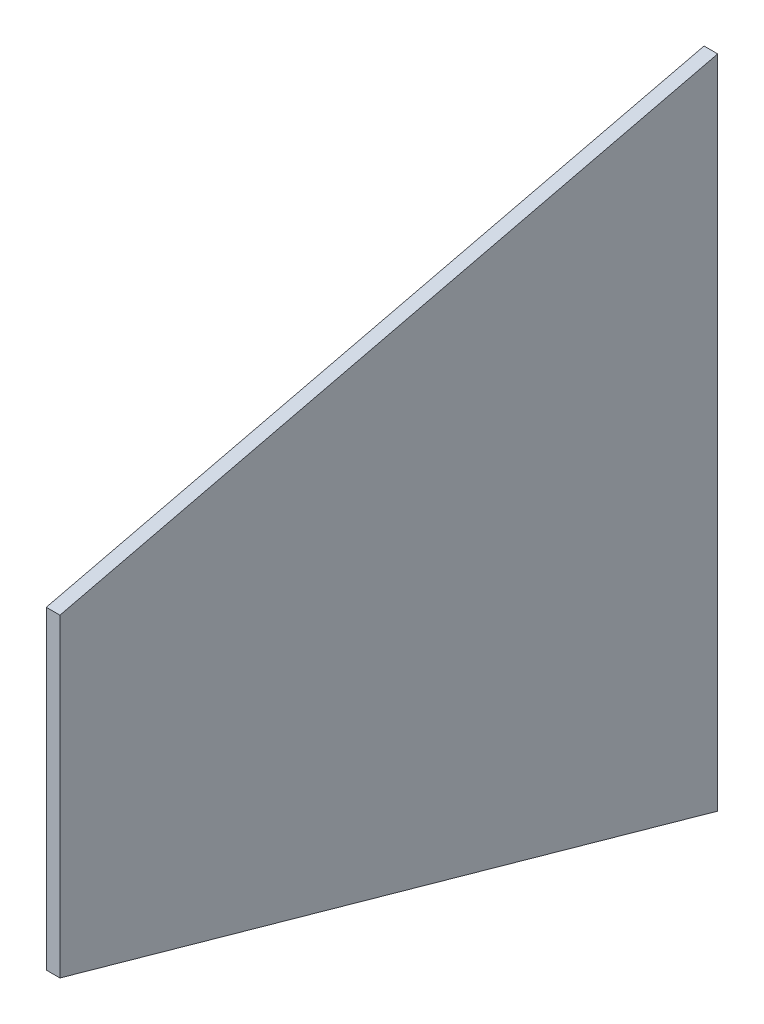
ISO-10303-21;
HEADER;
FILE_DESCRIPTION(('STEP AP214'),'2;1');
FILE_NAME('part.step','',(''),(''),'','','');
FILE_SCHEMA(('AUTOMOTIVE_DESIGN { 1 0 10303 214 1 1 1 1 }'));
ENDSEC;
DATA;
#1=APPLICATION_CONTEXT('core data for automotive mechanical design processes');
#2=APPLICATION_PROTOCOL_DEFINITION('international standard','automotive_design',2000,#1);
#3=PRODUCT_CONTEXT('',#1,'mechanical');
#4=PRODUCT('Part','Part','',(#3));
#5=PRODUCT_RELATED_PRODUCT_CATEGORY('part','',(#4));
#6=PRODUCT_DEFINITION_FORMATION('','',#4);
#7=PRODUCT_DEFINITION_CONTEXT('part definition',#1,'design');
#8=PRODUCT_DEFINITION('design','',#6,#7);
#9=PRODUCT_DEFINITION_SHAPE('','',#8);
#10=(LENGTH_UNIT() NAMED_UNIT(*) SI_UNIT(.MILLI.,.METRE.));
#11=(NAMED_UNIT(*) PLANE_ANGLE_UNIT() SI_UNIT($,.RADIAN.));
#12=(NAMED_UNIT(*) SI_UNIT($,.STERADIAN.) SOLID_ANGLE_UNIT());
#13=UNCERTAINTY_MEASURE_WITH_UNIT(LENGTH_MEASURE(1.E-05),#10,'distance_accuracy_value','');
#14=(GEOMETRIC_REPRESENTATION_CONTEXT(3) GLOBAL_UNCERTAINTY_ASSIGNED_CONTEXT((#13)) GLOBAL_UNIT_ASSIGNED_CONTEXT((#10,
#11,#12)) REPRESENTATION_CONTEXT('',''));
#15=CARTESIAN_POINT('',(0.,0.,0.));
#16=DIRECTION('',(0.,0.,1.));
#17=DIRECTION('',(1.,0.,0.));
#18=AXIS2_PLACEMENT_3D('',#15,#16,#17);
#19=CARTESIAN_POINT('',(6.35,85.69325,305.717053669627));
#20=DIRECTION('',(0.,0.962888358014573,-0.2699));
#21=DIRECTION('',(0.,0.2699,0.962888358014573));
#22=AXIS2_PLACEMENT_3D('',#19,#20,#21);
#23=PLANE('',#22);
#24=DIRECTION('',(0.,-0.2699,-0.962888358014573));
#25=VECTOR('',#24,1.);
#26=CARTESIAN_POINT('',(0.,85.69325,305.717053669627));
#27=LINE('',#26,#25);
#28=CARTESIAN_POINT('',(0.,85.69325,305.717053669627));
#29=VERTEX_POINT('',#28);
#30=CARTESIAN_POINT('',(0.,0.,0.));
#31=VERTEX_POINT('',#30);
#32=EDGE_CURVE('E111',#29,#31,#27,.T.);
#33=ORIENTED_EDGE('',*,*,#32,.T.);
#34=DIRECTION('',(-1.,0.,0.));
#35=VECTOR('',#34,1.);
#36=CARTESIAN_POINT('',(6.35,0.,0.));
#37=LINE('',#36,#35);
#38=CARTESIAN_POINT('',(6.35,0.,0.));
#39=VERTEX_POINT('',#38);
#40=EDGE_CURVE('E11',#39,#31,#37,.T.);
#41=ORIENTED_EDGE('',*,*,#40,.F.);
#42=DIRECTION('',(0.,-0.2699,-0.962888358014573));
#43=VECTOR('',#42,1.);
#44=CARTESIAN_POINT('',(6.35,85.69325,305.717053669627));
#45=LINE('',#44,#43);
#46=CARTESIAN_POINT('',(6.35,85.69325,305.717053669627));
#47=VERTEX_POINT('',#46);
#48=EDGE_CURVE('E100',#47,#39,#45,.T.);
#49=ORIENTED_EDGE('',*,*,#48,.F.);
#50=DIRECTION('',(-1.,0.,0.));
#51=VECTOR('',#50,1.);
#52=CARTESIAN_POINT('',(6.35,85.69325,305.717053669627));
#53=LINE('',#52,#51);
#54=EDGE_CURVE('E107',#47,#29,#53,.T.);
#55=ORIENTED_EDGE('',*,*,#54,.T.);
#56=EDGE_LOOP('',(#33,#41,#49,#55));
#57=FACE_BOUND('',#56,.T.);
#58=ADVANCED_FACE('F44',(#57),#23,.F.);
#59=CARTESIAN_POINT('',(6.35,0.,0.));
#60=DIRECTION('',(0.,0.,1.));
#61=DIRECTION('',(1.,0.,0.));
#62=AXIS2_PLACEMENT_3D('',#59,#60,#61);
#63=PLANE('',#62);
#64=DIRECTION('',(0.,1.,0.));
#65=VECTOR('',#64,1.);
#66=CARTESIAN_POINT('',(0.,0.,0.));
#67=LINE('',#66,#65);
#68=CARTESIAN_POINT('',(0.,304.8,0.));
#69=VERTEX_POINT('',#68);
#70=EDGE_CURVE('E105',#31,#69,#67,.T.);
#71=ORIENTED_EDGE('',*,*,#70,.T.);
#72=DIRECTION('',(-1.,0.,0.));
#73=VECTOR('',#72,1.);
#74=CARTESIAN_POINT('',(6.35,304.8,0.));
#75=LINE('',#74,#73);
#76=CARTESIAN_POINT('',(6.35,304.8,0.));
#77=VERTEX_POINT('',#76);
#78=EDGE_CURVE('E53',#77,#69,#75,.T.);
#79=ORIENTED_EDGE('',*,*,#78,.F.);
#80=DIRECTION('',(0.,1.,0.));
#81=VECTOR('',#80,1.);
#82=CARTESIAN_POINT('',(6.35,0.,0.));
#83=LINE('',#82,#81);
#84=EDGE_CURVE('E95',#39,#77,#83,.T.);
#85=ORIENTED_EDGE('',*,*,#84,.F.);
#86=ORIENTED_EDGE('',*,*,#40,.T.);
#87=EDGE_LOOP('',(#71,#79,#85,#86));
#88=FACE_BOUND('',#87,.T.);
#89=ADVANCED_FACE('F102',(#88),#63,.F.);
#90=CARTESIAN_POINT('',(6.35,304.8,0.));
#91=DIRECTION('',(0.,-0.972614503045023,-0.232424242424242));
#92=DIRECTION('',(0.,0.232424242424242,-0.972614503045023));
#93=AXIS2_PLACEMENT_3D('',#90,#91,#92);
#94=PLANE('',#93);
#95=DIRECTION('',(0.,-0.232424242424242,0.972614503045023));
#96=VECTOR('',#95,1.);
#97=CARTESIAN_POINT('',(0.,304.8,0.));
#98=LINE('',#97,#96);
#99=CARTESIAN_POINT('',(0.,231.74325,305.717053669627));
#100=VERTEX_POINT('',#99);
#101=EDGE_CURVE('E80',#69,#100,#98,.T.);
#102=ORIENTED_EDGE('',*,*,#101,.T.);
#103=DIRECTION('',(-1.,0.,0.));
#104=VECTOR('',#103,1.);
#105=CARTESIAN_POINT('',(6.35,231.74325,305.717053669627));
#106=LINE('',#105,#104);
#107=CARTESIAN_POINT('',(6.35,231.74325,305.717053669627));
#108=VERTEX_POINT('',#107);
#109=EDGE_CURVE('E101',#108,#100,#106,.T.);
#110=ORIENTED_EDGE('',*,*,#109,.F.);
#111=DIRECTION('',(0.,-0.232424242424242,0.972614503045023));
#112=VECTOR('',#111,1.);
#113=CARTESIAN_POINT('',(6.35,304.8,0.));
#114=LINE('',#113,#112);
#115=EDGE_CURVE('E94',#77,#108,#114,.T.);
#116=ORIENTED_EDGE('',*,*,#115,.F.);
#117=ORIENTED_EDGE('',*,*,#78,.T.);
#118=EDGE_LOOP('',(#102,#110,#116,#117));
#119=FACE_BOUND('',#118,.T.);
#120=ADVANCED_FACE('F103',(#119),#94,.F.);
#121=CARTESIAN_POINT('',(6.35,231.74325,305.717053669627));
#122=DIRECTION('',(0.,0.,-1.));
#123=DIRECTION('',(-1.,0.,0.));
#124=AXIS2_PLACEMENT_3D('',#121,#122,#123);
#125=PLANE('',#124);
#126=DIRECTION('',(0.,-1.,0.));
#127=VECTOR('',#126,1.);
#128=CARTESIAN_POINT('',(0.,231.74325,305.717053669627));
#129=LINE('',#128,#127);
#130=EDGE_CURVE('E82',#100,#29,#129,.T.);
#131=ORIENTED_EDGE('',*,*,#130,.T.);
#132=ORIENTED_EDGE('',*,*,#54,.F.);
#133=DIRECTION('',(0.,-1.,0.));
#134=VECTOR('',#133,1.);
#135=CARTESIAN_POINT('',(6.35,231.74325,305.717053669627));
#136=LINE('',#135,#134);
#137=EDGE_CURVE('E65',#108,#47,#136,.T.);
#138=ORIENTED_EDGE('',*,*,#137,.F.);
#139=ORIENTED_EDGE('',*,*,#109,.T.);
#140=EDGE_LOOP('',(#131,#132,#138,#139));
#141=FACE_BOUND('',#140,.T.);
#142=ADVANCED_FACE('F128',(#141),#125,.F.);
#143=CARTESIAN_POINT('',(6.35,0.,0.));
#144=DIRECTION('',(1.,0.,0.));
#145=DIRECTION('',(0.,0.,-1.));
#146=AXIS2_PLACEMENT_3D('',#143,#144,#145);
#147=PLANE('',#146);
#148=ORIENTED_EDGE('',*,*,#48,.T.);
#149=ORIENTED_EDGE('',*,*,#84,.T.);
#150=ORIENTED_EDGE('',*,*,#115,.T.);
#151=ORIENTED_EDGE('',*,*,#137,.T.);
#152=EDGE_LOOP('',(#148,#149,#150,#151));
#153=FACE_BOUND('',#152,.T.);
#154=ADVANCED_FACE('F93',(#153),#147,.T.);
#155=CARTESIAN_POINT('',(0.,0.,0.));
#156=DIRECTION('',(1.,0.,0.));
#157=DIRECTION('',(0.,0.,-1.));
#158=AXIS2_PLACEMENT_3D('',#155,#156,#157);
#159=PLANE('',#158);
#160=ORIENTED_EDGE('',*,*,#32,.F.);
#161=ORIENTED_EDGE('',*,*,#130,.F.);
#162=ORIENTED_EDGE('',*,*,#101,.F.);
#163=ORIENTED_EDGE('',*,*,#70,.F.);
#164=EDGE_LOOP('',(#160,#161,#162,#163));
#165=FACE_BOUND('',#164,.T.);
#166=ADVANCED_FACE('F129',(#165),#159,.F.);
#167=CLOSED_SHELL('',(#58,#89,#120,#142,#154,#166));
#168=MANIFOLD_SOLID_BREP('B2',#167);
#169=ADVANCED_BREP_SHAPE_REPRESENTATION('',(#18,#168),#14);
#170=SHAPE_DEFINITION_REPRESENTATION(#9,#169);
ENDSEC;
END-ISO-10303-21;
